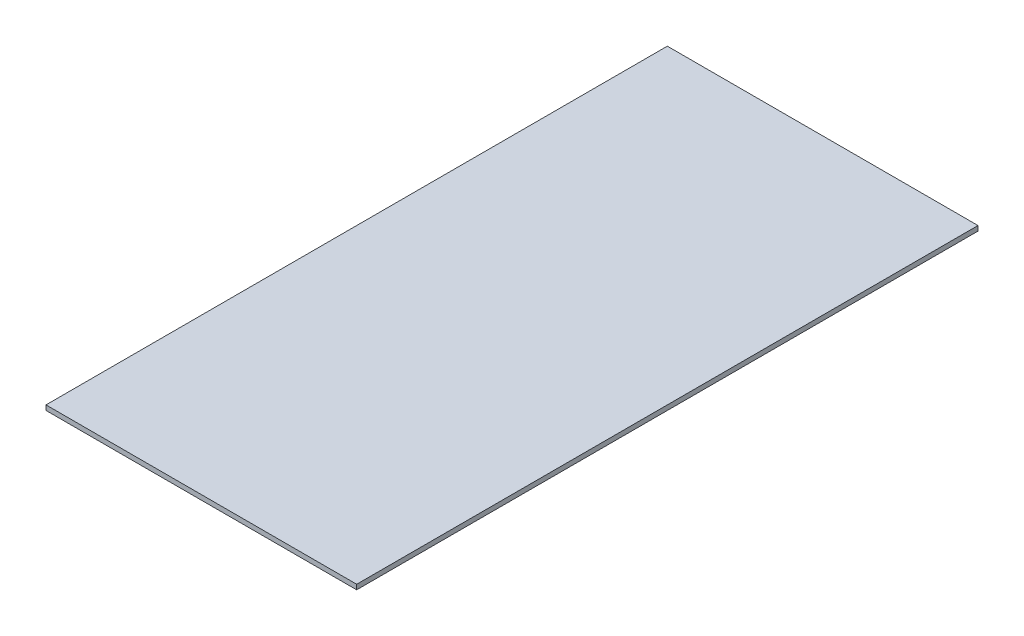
from build123d import *

# Parameters (mm, degrees)
SKETCH1_W      = 1219.2
SKETCH1_H      = 2438.4
EXTRUDE1_DEPTH = 19.05


with BuildPart() as part:
    # Sketch1 → Extrude1 (new body)
    with BuildSketch(Plane(origin=(0, 0, 0), x_dir=(1, 0, 0), z_dir=(0, 1, 0))):
        with Locations((609.6, 1219.2)):
            Rectangle(SKETCH1_W, SKETCH1_H)
    extrude(amount=EXTRUDE1_DEPTH)


solid = part.part
